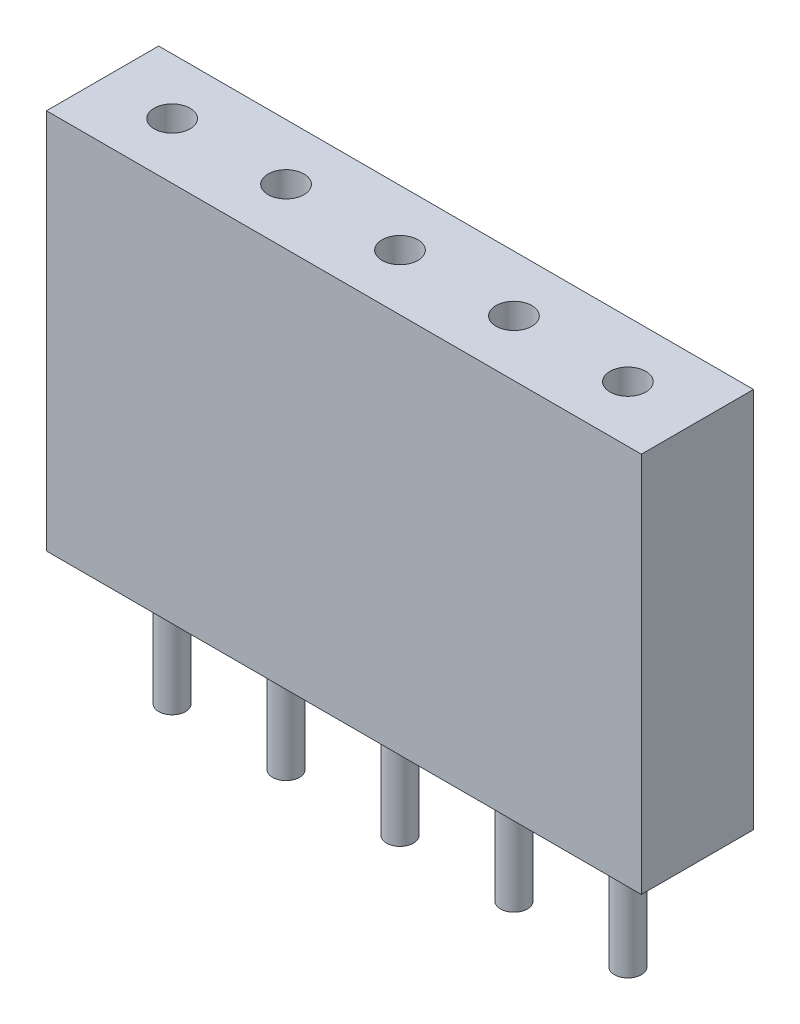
ISO-10303-21;
HEADER;
FILE_DESCRIPTION(('STEP AP214'),'2;1');
FILE_NAME('part.step','',(''),(''),'','','');
FILE_SCHEMA(('AUTOMOTIVE_DESIGN { 1 0 10303 214 1 1 1 1 }'));
ENDSEC;
DATA;
#1=APPLICATION_CONTEXT('core data for automotive mechanical design processes');
#2=APPLICATION_PROTOCOL_DEFINITION('international standard','automotive_design',2000,#1);
#3=PRODUCT_CONTEXT('',#1,'mechanical');
#4=PRODUCT('Part','Part','',(#3));
#5=PRODUCT_RELATED_PRODUCT_CATEGORY('part','',(#4));
#6=PRODUCT_DEFINITION_FORMATION('','',#4);
#7=PRODUCT_DEFINITION_CONTEXT('part definition',#1,'design');
#8=PRODUCT_DEFINITION('design','',#6,#7);
#9=PRODUCT_DEFINITION_SHAPE('','',#8);
#10=(LENGTH_UNIT() NAMED_UNIT(*) SI_UNIT(.MILLI.,.METRE.));
#11=(NAMED_UNIT(*) PLANE_ANGLE_UNIT() SI_UNIT($,.RADIAN.));
#12=(NAMED_UNIT(*) SI_UNIT($,.STERADIAN.) SOLID_ANGLE_UNIT());
#13=UNCERTAINTY_MEASURE_WITH_UNIT(LENGTH_MEASURE(1.E-05),#10,'distance_accuracy_value','');
#14=(GEOMETRIC_REPRESENTATION_CONTEXT(3) GLOBAL_UNCERTAINTY_ASSIGNED_CONTEXT((#13)) GLOBAL_UNIT_ASSIGNED_CONTEXT((#10,
#11,#12)) REPRESENTATION_CONTEXT('',''));
#15=CARTESIAN_POINT('',(0.,0.,0.));
#16=DIRECTION('',(0.,0.,1.));
#17=DIRECTION('',(1.,0.,0.));
#18=AXIS2_PLACEMENT_3D('',#15,#16,#17);
#19=CARTESIAN_POINT('',(0.,0.,2.5));
#20=DIRECTION('',(0.,1.,0.));
#21=DIRECTION('',(0.,0.,1.));
#22=AXIS2_PLACEMENT_3D('',#19,#20,#21);
#23=PLANE('',#22);
#24=CARTESIAN_POINT('',(4.09,0.,1.24999999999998));
#25=DIRECTION('',(0.,1.,0.));
#26=DIRECTION('',(0.,0.,1.));
#27=AXIS2_PLACEMENT_3D('',#24,#25,#26);
#28=CIRCLE('',#27,0.3);
#29=CARTESIAN_POINT('',(4.09,0.,1.54999999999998));
#30=VERTEX_POINT('',#29);
#31=EDGE_CURVE('E45',#30,#30,#28,.F.);
#32=ORIENTED_EDGE('',*,*,#31,.F.);
#33=EDGE_LOOP('',(#32));
#34=FACE_BOUND('',#33,.T.);
#35=CARTESIAN_POINT('',(9.17,0.,1.25));
#36=DIRECTION('',(0.,1.,0.));
#37=DIRECTION('',(0.,0.,1.));
#38=AXIS2_PLACEMENT_3D('',#35,#36,#37);
#39=CIRCLE('',#38,0.3);
#40=CARTESIAN_POINT('',(9.17,0.,1.55));
#41=VERTEX_POINT('',#40);
#42=EDGE_CURVE('E117',#41,#41,#39,.F.);
#43=ORIENTED_EDGE('',*,*,#42,.F.);
#44=EDGE_LOOP('',(#43));
#45=FACE_BOUND('',#44,.T.);
#46=DIRECTION('',(1.,0.,0.));
#47=VECTOR('',#46,1.);
#48=CARTESIAN_POINT('',(0.,0.,0.));
#49=LINE('',#48,#47);
#50=CARTESIAN_POINT('',(0.,0.,0.));
#51=VERTEX_POINT('',#50);
#52=CARTESIAN_POINT('',(13.26,0.,0.));
#53=VERTEX_POINT('',#52);
#54=EDGE_CURVE('E94',#51,#53,#49,.T.);
#55=ORIENTED_EDGE('',*,*,#54,.T.);
#56=DIRECTION('',(0.,0.,-1.));
#57=VECTOR('',#56,1.);
#58=CARTESIAN_POINT('',(13.26,0.,2.5));
#59=LINE('',#58,#57);
#60=CARTESIAN_POINT('',(13.26,0.,2.5));
#61=VERTEX_POINT('',#60);
#62=EDGE_CURVE('E92',#61,#53,#59,.T.);
#63=ORIENTED_EDGE('',*,*,#62,.F.);
#64=DIRECTION('',(1.,0.,0.));
#65=VECTOR('',#64,1.);
#66=CARTESIAN_POINT('',(0.,0.,2.5));
#67=LINE('',#66,#65);
#68=CARTESIAN_POINT('',(0.,0.,2.5));
#69=VERTEX_POINT('',#68);
#70=EDGE_CURVE('E84',#69,#61,#67,.T.);
#71=ORIENTED_EDGE('',*,*,#70,.F.);
#72=DIRECTION('',(0.,0.,-1.));
#73=VECTOR('',#72,1.);
#74=CARTESIAN_POINT('',(0.,0.,2.5));
#75=LINE('',#74,#73);
#76=EDGE_CURVE('E95',#69,#51,#75,.T.);
#77=ORIENTED_EDGE('',*,*,#76,.T.);
#78=EDGE_LOOP('',(#55,#63,#71,#77));
#79=FACE_BOUND('',#78,.T.);
#80=CARTESIAN_POINT('',(6.63,0.,1.25));
#81=DIRECTION('',(0.,1.,0.));
#82=DIRECTION('',(0.,0.,1.));
#83=AXIS2_PLACEMENT_3D('',#80,#81,#82);
#84=CIRCLE('',#83,0.3);
#85=CARTESIAN_POINT('',(6.63,0.,1.55));
#86=VERTEX_POINT('',#85);
#87=EDGE_CURVE('E114',#86,#86,#84,.F.);
#88=ORIENTED_EDGE('',*,*,#87,.F.);
#89=EDGE_LOOP('',(#88));
#90=FACE_BOUND('',#89,.T.);
#91=CARTESIAN_POINT('',(11.71,0.,1.25));
#92=DIRECTION('',(0.,1.,0.));
#93=DIRECTION('',(0.,0.,1.));
#94=AXIS2_PLACEMENT_3D('',#91,#92,#93);
#95=CIRCLE('',#94,0.3);
#96=CARTESIAN_POINT('',(11.71,0.,1.55));
#97=VERTEX_POINT('',#96);
#98=EDGE_CURVE('E120',#97,#97,#95,.F.);
#99=ORIENTED_EDGE('',*,*,#98,.F.);
#100=EDGE_LOOP('',(#99));
#101=FACE_BOUND('',#100,.T.);
#102=CARTESIAN_POINT('',(1.55,0.,1.24999999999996));
#103=DIRECTION('',(0.,1.,0.));
#104=DIRECTION('',(0.,0.,1.));
#105=AXIS2_PLACEMENT_3D('',#102,#103,#104);
#106=CIRCLE('',#105,0.3);
#107=CARTESIAN_POINT('',(1.55,0.,1.54999999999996));
#108=VERTEX_POINT('',#107);
#109=EDGE_CURVE('E11',#108,#108,#106,.F.);
#110=ORIENTED_EDGE('',*,*,#109,.F.);
#111=EDGE_LOOP('',(#110));
#112=FACE_BOUND('',#111,.T.);
#113=ADVANCED_FACE('F36',(#34,#45,#79,#90,#101,#112),#23,.F.);
#114=CARTESIAN_POINT('',(0.,0.,2.5));
#115=DIRECTION('',(1.,0.,0.));
#116=DIRECTION('',(0.,0.,-1.));
#117=AXIS2_PLACEMENT_3D('',#114,#115,#116);
#118=PLANE('',#117);
#119=DIRECTION('',(0.,-1.,0.));
#120=VECTOR('',#119,1.);
#121=CARTESIAN_POINT('',(0.,0.,0.));
#122=LINE('',#121,#120);
#123=CARTESIAN_POINT('',(0.,8.5,0.));
#124=VERTEX_POINT('',#123);
#125=EDGE_CURVE('E104',#124,#51,#122,.T.);
#126=ORIENTED_EDGE('',*,*,#125,.T.);
#127=ORIENTED_EDGE('',*,*,#76,.F.);
#128=DIRECTION('',(0.,-1.,0.));
#129=VECTOR('',#128,1.);
#130=CARTESIAN_POINT('',(0.,0.,2.5));
#131=LINE('',#130,#129);
#132=CARTESIAN_POINT('',(0.,8.5,2.5));
#133=VERTEX_POINT('',#132);
#134=EDGE_CURVE('E89',#133,#69,#131,.T.);
#135=ORIENTED_EDGE('',*,*,#134,.F.);
#136=DIRECTION('',(0.,0.,-1.));
#137=VECTOR('',#136,1.);
#138=CARTESIAN_POINT('',(0.,8.5,2.5));
#139=LINE('',#138,#137);
#140=EDGE_CURVE('E100',#133,#124,#139,.T.);
#141=ORIENTED_EDGE('',*,*,#140,.T.);
#142=EDGE_LOOP('',(#126,#127,#135,#141));
#143=FACE_BOUND('',#142,.T.);
#144=ADVANCED_FACE('F38',(#143),#118,.F.);
#145=CARTESIAN_POINT('',(13.26,0.,2.5));
#146=DIRECTION('',(-1.,0.,0.));
#147=DIRECTION('',(0.,0.,1.));
#148=AXIS2_PLACEMENT_3D('',#145,#146,#147);
#149=PLANE('',#148);
#150=DIRECTION('',(0.,1.,0.));
#151=VECTOR('',#150,1.);
#152=CARTESIAN_POINT('',(13.26,0.,0.));
#153=LINE('',#152,#151);
#154=CARTESIAN_POINT('',(13.26,8.5,0.));
#155=VERTEX_POINT('',#154);
#156=EDGE_CURVE('E70',#53,#155,#153,.T.);
#157=ORIENTED_EDGE('',*,*,#156,.T.);
#158=DIRECTION('',(0.,0.,-1.));
#159=VECTOR('',#158,1.);
#160=CARTESIAN_POINT('',(13.26,8.5,2.5));
#161=LINE('',#160,#159);
#162=CARTESIAN_POINT('',(13.26,8.5,2.5));
#163=VERTEX_POINT('',#162);
#164=EDGE_CURVE('E96',#163,#155,#161,.T.);
#165=ORIENTED_EDGE('',*,*,#164,.F.);
#166=DIRECTION('',(0.,1.,0.));
#167=VECTOR('',#166,1.);
#168=CARTESIAN_POINT('',(13.26,0.,2.5));
#169=LINE('',#168,#167);
#170=EDGE_CURVE('E87',#61,#163,#169,.T.);
#171=ORIENTED_EDGE('',*,*,#170,.F.);
#172=ORIENTED_EDGE('',*,*,#62,.T.);
#173=EDGE_LOOP('',(#157,#165,#171,#172));
#174=FACE_BOUND('',#173,.T.);
#175=ADVANCED_FACE('F98',(#174),#149,.F.);
#176=CARTESIAN_POINT('',(0.,8.5,2.5));
#177=DIRECTION('',(0.,-1.,0.));
#178=DIRECTION('',(0.,0.,-1.));
#179=AXIS2_PLACEMENT_3D('',#176,#177,#178);
#180=PLANE('',#179);
#181=CARTESIAN_POINT('',(1.55,8.5,1.25000000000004));
#182=DIRECTION('',(0.,1.,0.));
#183=DIRECTION('',(0.,0.,1.));
#184=AXIS2_PLACEMENT_3D('',#181,#182,#183);
#185=CIRCLE('',#184,0.4);
#186=CARTESIAN_POINT('',(1.55,8.5,1.65000000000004));
#187=VERTEX_POINT('',#186);
#188=EDGE_CURVE('E211',#187,#187,#185,.T.);
#189=ORIENTED_EDGE('',*,*,#188,.F.);
#190=EDGE_LOOP('',(#189));
#191=FACE_BOUND('',#190,.T.);
#192=CARTESIAN_POINT('',(4.09,8.5,1.25000000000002));
#193=DIRECTION('',(0.,1.,0.));
#194=DIRECTION('',(0.,0.,1.));
#195=AXIS2_PLACEMENT_3D('',#192,#193,#194);
#196=CIRCLE('',#195,0.400000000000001);
#197=CARTESIAN_POINT('',(4.09,8.5,1.65000000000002));
#198=VERTEX_POINT('',#197);
#199=EDGE_CURVE('E205',#198,#198,#196,.T.);
#200=ORIENTED_EDGE('',*,*,#199,.F.);
#201=EDGE_LOOP('',(#200));
#202=FACE_BOUND('',#201,.T.);
#203=CARTESIAN_POINT('',(11.71,8.5,1.25));
#204=DIRECTION('',(0.,1.,0.));
#205=DIRECTION('',(0.,0.,1.));
#206=AXIS2_PLACEMENT_3D('',#203,#204,#205);
#207=CIRCLE('',#206,0.4);
#208=CARTESIAN_POINT('',(11.71,8.5,1.65));
#209=VERTEX_POINT('',#208);
#210=EDGE_CURVE('E199',#209,#209,#207,.T.);
#211=ORIENTED_EDGE('',*,*,#210,.F.);
#212=EDGE_LOOP('',(#211));
#213=FACE_BOUND('',#212,.T.);
#214=CARTESIAN_POINT('',(9.17,8.5,1.25));
#215=DIRECTION('',(0.,1.,0.));
#216=DIRECTION('',(0.,0.,1.));
#217=AXIS2_PLACEMENT_3D('',#214,#215,#216);
#218=CIRCLE('',#217,0.4);
#219=CARTESIAN_POINT('',(9.17,8.5,1.65));
#220=VERTEX_POINT('',#219);
#221=EDGE_CURVE('E193',#220,#220,#218,.T.);
#222=ORIENTED_EDGE('',*,*,#221,.F.);
#223=EDGE_LOOP('',(#222));
#224=FACE_BOUND('',#223,.T.);
#225=CARTESIAN_POINT('',(6.63,8.5,1.25));
#226=DIRECTION('',(0.,1.,0.));
#227=DIRECTION('',(0.,0.,1.));
#228=AXIS2_PLACEMENT_3D('',#225,#226,#227);
#229=CIRCLE('',#228,0.4);
#230=CARTESIAN_POINT('',(6.63,8.5,1.65));
#231=VERTEX_POINT('',#230);
#232=EDGE_CURVE('E187',#231,#231,#229,.T.);
#233=ORIENTED_EDGE('',*,*,#232,.F.);
#234=EDGE_LOOP('',(#233));
#235=FACE_BOUND('',#234,.T.);
#236=DIRECTION('',(-1.,0.,0.));
#237=VECTOR('',#236,1.);
#238=CARTESIAN_POINT('',(0.,8.5,0.));
#239=LINE('',#238,#237);
#240=EDGE_CURVE('E76',#155,#124,#239,.T.);
#241=ORIENTED_EDGE('',*,*,#240,.T.);
#242=ORIENTED_EDGE('',*,*,#140,.F.);
#243=DIRECTION('',(-1.,0.,0.));
#244=VECTOR('',#243,1.);
#245=CARTESIAN_POINT('',(0.,8.5,2.5));
#246=LINE('',#245,#244);
#247=EDGE_CURVE('E53',#163,#133,#246,.T.);
#248=ORIENTED_EDGE('',*,*,#247,.F.);
#249=ORIENTED_EDGE('',*,*,#164,.T.);
#250=EDGE_LOOP('',(#241,#242,#248,#249));
#251=FACE_BOUND('',#250,.T.);
#252=ADVANCED_FACE('F156',(#191,#202,#213,#224,#235,#251),#180,.F.);
#253=CARTESIAN_POINT('',(0.,0.,2.5));
#254=DIRECTION('',(0.,0.,-1.));
#255=DIRECTION('',(-1.,0.,0.));
#256=AXIS2_PLACEMENT_3D('',#253,#254,#255);
#257=PLANE('',#256);
#258=ORIENTED_EDGE('',*,*,#134,.T.);
#259=ORIENTED_EDGE('',*,*,#70,.T.);
#260=ORIENTED_EDGE('',*,*,#170,.T.);
#261=ORIENTED_EDGE('',*,*,#247,.T.);
#262=EDGE_LOOP('',(#258,#259,#260,#261));
#263=FACE_BOUND('',#262,.T.);
#264=ADVANCED_FACE('F85',(#263),#257,.F.);
#265=CARTESIAN_POINT('',(0.,0.,0.));
#266=DIRECTION('',(0.,0.,-1.));
#267=DIRECTION('',(-1.,0.,0.));
#268=AXIS2_PLACEMENT_3D('',#265,#266,#267);
#269=PLANE('',#268);
#270=ORIENTED_EDGE('',*,*,#125,.F.);
#271=ORIENTED_EDGE('',*,*,#240,.F.);
#272=ORIENTED_EDGE('',*,*,#156,.F.);
#273=ORIENTED_EDGE('',*,*,#54,.F.);
#274=EDGE_LOOP('',(#270,#271,#272,#273));
#275=FACE_BOUND('',#274,.T.);
#276=ADVANCED_FACE('F152',(#275),#269,.T.);
#277=CARTESIAN_POINT('',(6.63,-2.8,1.25));
#278=DIRECTION('',(0.,1.,0.));
#279=DIRECTION('',(0.,0.,1.));
#280=AXIS2_PLACEMENT_3D('',#277,#278,#279);
#281=CYLINDRICAL_SURFACE('',#280,0.3);
#282=CARTESIAN_POINT('',(6.63,-2.8,1.25));
#283=DIRECTION('',(0.,-1.,0.));
#284=DIRECTION('',(0.,0.,-1.));
#285=AXIS2_PLACEMENT_3D('',#282,#283,#284);
#286=CIRCLE('',#285,0.3);
#287=CARTESIAN_POINT('',(6.63,-2.8,0.95));
#288=VERTEX_POINT('',#287);
#289=EDGE_CURVE('E107',#288,#288,#286,.T.);
#290=ORIENTED_EDGE('',*,*,#289,.F.);
#291=EDGE_LOOP('',(#290));
#292=FACE_BOUND('',#291,.T.);
#293=ORIENTED_EDGE('',*,*,#87,.T.);
#294=EDGE_LOOP('',(#293));
#295=FACE_BOUND('',#294,.T.);
#296=ADVANCED_FACE('F144',(#292,#295),#281,.T.);
#297=CARTESIAN_POINT('',(6.63,-2.8,1.25));
#298=DIRECTION('',(0.,-1.,0.));
#299=DIRECTION('',(0.,0.,-1.));
#300=AXIS2_PLACEMENT_3D('',#297,#298,#299);
#301=PLANE('',#300);
#302=ORIENTED_EDGE('',*,*,#289,.T.);
#303=EDGE_LOOP('',(#302));
#304=FACE_BOUND('',#303,.T.);
#305=ADVANCED_FACE('F134',(#304),#301,.T.);
#306=CARTESIAN_POINT('',(9.17,-2.8,1.25));
#307=DIRECTION('',(0.,1.,0.));
#308=DIRECTION('',(0.,0.,1.));
#309=AXIS2_PLACEMENT_3D('',#306,#307,#308);
#310=CYLINDRICAL_SURFACE('',#309,0.3);
#311=CARTESIAN_POINT('',(9.17,-2.8,1.25));
#312=DIRECTION('',(0.,-1.,0.));
#313=DIRECTION('',(0.,0.,-1.));
#314=AXIS2_PLACEMENT_3D('',#311,#312,#313);
#315=CIRCLE('',#314,0.3);
#316=CARTESIAN_POINT('',(9.17,-2.8,0.95));
#317=VERTEX_POINT('',#316);
#318=EDGE_CURVE('E174',#317,#317,#315,.T.);
#319=ORIENTED_EDGE('',*,*,#318,.F.);
#320=EDGE_LOOP('',(#319));
#321=FACE_BOUND('',#320,.T.);
#322=ORIENTED_EDGE('',*,*,#42,.T.);
#323=EDGE_LOOP('',(#322));
#324=FACE_BOUND('',#323,.T.);
#325=ADVANCED_FACE('F131',(#321,#324),#310,.T.);
#326=CARTESIAN_POINT('',(9.17,-2.8,1.25));
#327=DIRECTION('',(0.,-1.,0.));
#328=DIRECTION('',(0.,0.,-1.));
#329=AXIS2_PLACEMENT_3D('',#326,#327,#328);
#330=PLANE('',#329);
#331=ORIENTED_EDGE('',*,*,#318,.T.);
#332=EDGE_LOOP('',(#331));
#333=FACE_BOUND('',#332,.T.);
#334=ADVANCED_FACE('F133',(#333),#330,.T.);
#335=CARTESIAN_POINT('',(11.71,-2.8,1.25));
#336=DIRECTION('',(0.,1.,0.));
#337=DIRECTION('',(0.,0.,1.));
#338=AXIS2_PLACEMENT_3D('',#335,#336,#337);
#339=CYLINDRICAL_SURFACE('',#338,0.3);
#340=CARTESIAN_POINT('',(11.71,-2.8,1.25));
#341=DIRECTION('',(0.,-1.,0.));
#342=DIRECTION('',(0.,0.,-1.));
#343=AXIS2_PLACEMENT_3D('',#340,#341,#342);
#344=CIRCLE('',#343,0.3);
#345=CARTESIAN_POINT('',(11.71,-2.8,0.95));
#346=VERTEX_POINT('',#345);
#347=EDGE_CURVE('E177',#346,#346,#344,.T.);
#348=ORIENTED_EDGE('',*,*,#347,.F.);
#349=EDGE_LOOP('',(#348));
#350=FACE_BOUND('',#349,.T.);
#351=ORIENTED_EDGE('',*,*,#98,.T.);
#352=EDGE_LOOP('',(#351));
#353=FACE_BOUND('',#352,.T.);
#354=ADVANCED_FACE('F141',(#350,#353),#339,.T.);
#355=CARTESIAN_POINT('',(11.71,-2.8,1.25));
#356=DIRECTION('',(0.,-1.,0.));
#357=DIRECTION('',(0.,0.,-1.));
#358=AXIS2_PLACEMENT_3D('',#355,#356,#357);
#359=PLANE('',#358);
#360=ORIENTED_EDGE('',*,*,#347,.T.);
#361=EDGE_LOOP('',(#360));
#362=FACE_BOUND('',#361,.T.);
#363=ADVANCED_FACE('F262',(#362),#359,.T.);
#364=CARTESIAN_POINT('',(4.09,-2.8,1.24999999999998));
#365=DIRECTION('',(0.,1.,0.));
#366=DIRECTION('',(0.,0.,1.));
#367=AXIS2_PLACEMENT_3D('',#364,#365,#366);
#368=CYLINDRICAL_SURFACE('',#367,0.3);
#369=CARTESIAN_POINT('',(4.09,-2.8,1.24999999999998));
#370=DIRECTION('',(0.,-1.,0.));
#371=DIRECTION('',(0.,0.,-1.));
#372=AXIS2_PLACEMENT_3D('',#369,#370,#371);
#373=CIRCLE('',#372,0.3);
#374=CARTESIAN_POINT('',(4.09,-2.8,0.949999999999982));
#375=VERTEX_POINT('',#374);
#376=EDGE_CURVE('E180',#375,#375,#373,.T.);
#377=ORIENTED_EDGE('',*,*,#376,.F.);
#378=EDGE_LOOP('',(#377));
#379=FACE_BOUND('',#378,.T.);
#380=ORIENTED_EDGE('',*,*,#31,.T.);
#381=EDGE_LOOP('',(#380));
#382=FACE_BOUND('',#381,.T.);
#383=ADVANCED_FACE('F125',(#379,#382),#368,.T.);
#384=CARTESIAN_POINT('',(4.09,-2.8,1.24999999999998));
#385=DIRECTION('',(0.,-1.,0.));
#386=DIRECTION('',(0.,0.,-1.));
#387=AXIS2_PLACEMENT_3D('',#384,#385,#386);
#388=PLANE('',#387);
#389=ORIENTED_EDGE('',*,*,#376,.T.);
#390=EDGE_LOOP('',(#389));
#391=FACE_BOUND('',#390,.T.);
#392=ADVANCED_FACE('F255',(#391),#388,.T.);
#393=CARTESIAN_POINT('',(1.55,-2.8,1.24999999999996));
#394=DIRECTION('',(0.,1.,0.));
#395=DIRECTION('',(0.,0.,1.));
#396=AXIS2_PLACEMENT_3D('',#393,#394,#395);
#397=CYLINDRICAL_SURFACE('',#396,0.3);
#398=CARTESIAN_POINT('',(1.55,-2.8,1.24999999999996));
#399=DIRECTION('',(0.,-1.,0.));
#400=DIRECTION('',(0.,0.,-1.));
#401=AXIS2_PLACEMENT_3D('',#398,#399,#400);
#402=CIRCLE('',#401,0.3);
#403=CARTESIAN_POINT('',(1.55,-2.8,0.949999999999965));
#404=VERTEX_POINT('',#403);
#405=EDGE_CURVE('E183',#404,#404,#402,.T.);
#406=ORIENTED_EDGE('',*,*,#405,.F.);
#407=EDGE_LOOP('',(#406));
#408=FACE_BOUND('',#407,.T.);
#409=ORIENTED_EDGE('',*,*,#109,.T.);
#410=EDGE_LOOP('',(#409));
#411=FACE_BOUND('',#410,.T.);
#412=ADVANCED_FACE('F247',(#408,#411),#397,.T.);
#413=CARTESIAN_POINT('',(1.55,-2.8,1.24999999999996));
#414=DIRECTION('',(0.,-1.,0.));
#415=DIRECTION('',(0.,0.,-1.));
#416=AXIS2_PLACEMENT_3D('',#413,#414,#415);
#417=PLANE('',#416);
#418=ORIENTED_EDGE('',*,*,#405,.T.);
#419=EDGE_LOOP('',(#418));
#420=FACE_BOUND('',#419,.T.);
#421=ADVANCED_FACE('F237',(#420),#417,.T.);
#422=CARTESIAN_POINT('',(6.63,1.5,1.25));
#423=DIRECTION('',(0.,1.,0.));
#424=DIRECTION('',(0.,0.,1.));
#425=AXIS2_PLACEMENT_3D('',#422,#423,#424);
#426=CYLINDRICAL_SURFACE('',#425,0.4);
#427=CARTESIAN_POINT('',(6.63,1.5,1.25));
#428=DIRECTION('',(0.,1.,0.));
#429=DIRECTION('',(0.,0.,1.));
#430=AXIS2_PLACEMENT_3D('',#427,#428,#429);
#431=CIRCLE('',#430,0.4);
#432=CARTESIAN_POINT('',(6.63,1.5,1.65));
#433=VERTEX_POINT('',#432);
#434=EDGE_CURVE('E186',#433,#433,#431,.T.);
#435=ORIENTED_EDGE('',*,*,#434,.F.);
#436=EDGE_LOOP('',(#435));
#437=FACE_BOUND('',#436,.T.);
#438=ORIENTED_EDGE('',*,*,#232,.T.);
#439=EDGE_LOOP('',(#438));
#440=FACE_BOUND('',#439,.T.);
#441=ADVANCED_FACE('F234',(#437,#440),#426,.F.);
#442=CARTESIAN_POINT('',(6.63,1.5,1.25));
#443=DIRECTION('',(0.,1.,0.));
#444=DIRECTION('',(0.,0.,1.));
#445=AXIS2_PLACEMENT_3D('',#442,#443,#444);
#446=PLANE('',#445);
#447=ORIENTED_EDGE('',*,*,#434,.T.);
#448=EDGE_LOOP('',(#447));
#449=FACE_BOUND('',#448,.T.);
#450=ADVANCED_FACE('F236',(#449),#446,.T.);
#451=CARTESIAN_POINT('',(9.17,1.5,1.25));
#452=DIRECTION('',(0.,1.,0.));
#453=DIRECTION('',(0.,0.,1.));
#454=AXIS2_PLACEMENT_3D('',#451,#452,#453);
#455=CYLINDRICAL_SURFACE('',#454,0.4);
#456=CARTESIAN_POINT('',(9.17,1.5,1.25));
#457=DIRECTION('',(0.,1.,0.));
#458=DIRECTION('',(0.,0.,1.));
#459=AXIS2_PLACEMENT_3D('',#456,#457,#458);
#460=CIRCLE('',#459,0.4);
#461=CARTESIAN_POINT('',(9.17,1.5,1.65));
#462=VERTEX_POINT('',#461);
#463=EDGE_CURVE('E190',#462,#462,#460,.T.);
#464=ORIENTED_EDGE('',*,*,#463,.F.);
#465=EDGE_LOOP('',(#464));
#466=FACE_BOUND('',#465,.T.);
#467=ORIENTED_EDGE('',*,*,#221,.T.);
#468=EDGE_LOOP('',(#467));
#469=FACE_BOUND('',#468,.T.);
#470=ADVANCED_FACE('F244',(#466,#469),#455,.F.);
#471=CARTESIAN_POINT('',(9.17,1.5,1.25));
#472=DIRECTION('',(0.,1.,0.));
#473=DIRECTION('',(0.,0.,1.));
#474=AXIS2_PLACEMENT_3D('',#471,#472,#473);
#475=PLANE('',#474);
#476=ORIENTED_EDGE('',*,*,#463,.T.);
#477=EDGE_LOOP('',(#476));
#478=FACE_BOUND('',#477,.T.);
#479=ADVANCED_FACE('F336',(#478),#475,.T.);
#480=CARTESIAN_POINT('',(11.71,1.5,1.25));
#481=DIRECTION('',(0.,1.,0.));
#482=DIRECTION('',(0.,0.,1.));
#483=AXIS2_PLACEMENT_3D('',#480,#481,#482);
#484=CYLINDRICAL_SURFACE('',#483,0.4);
#485=CARTESIAN_POINT('',(11.71,1.5,1.25));
#486=DIRECTION('',(0.,1.,0.));
#487=DIRECTION('',(0.,0.,1.));
#488=AXIS2_PLACEMENT_3D('',#485,#486,#487);
#489=CIRCLE('',#488,0.4);
#490=CARTESIAN_POINT('',(11.71,1.5,1.65));
#491=VERTEX_POINT('',#490);
#492=EDGE_CURVE('E196',#491,#491,#489,.T.);
#493=ORIENTED_EDGE('',*,*,#492,.F.);
#494=EDGE_LOOP('',(#493));
#495=FACE_BOUND('',#494,.T.);
#496=ORIENTED_EDGE('',*,*,#210,.T.);
#497=EDGE_LOOP('',(#496));
#498=FACE_BOUND('',#497,.T.);
#499=ADVANCED_FACE('F345',(#495,#498),#484,.F.);
#500=CARTESIAN_POINT('',(11.71,1.5,1.25));
#501=DIRECTION('',(0.,1.,0.));
#502=DIRECTION('',(0.,0.,1.));
#503=AXIS2_PLACEMENT_3D('',#500,#501,#502);
#504=PLANE('',#503);
#505=ORIENTED_EDGE('',*,*,#492,.T.);
#506=EDGE_LOOP('',(#505));
#507=FACE_BOUND('',#506,.T.);
#508=ADVANCED_FACE('F355',(#507),#504,.T.);
#509=CARTESIAN_POINT('',(4.09,1.5,1.25000000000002));
#510=DIRECTION('',(0.,1.,0.));
#511=DIRECTION('',(0.,0.,1.));
#512=AXIS2_PLACEMENT_3D('',#509,#510,#511);
#513=CYLINDRICAL_SURFACE('',#512,0.400000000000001);
#514=CARTESIAN_POINT('',(4.09,1.5,1.25000000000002));
#515=DIRECTION('',(0.,1.,0.));
#516=DIRECTION('',(0.,0.,1.));
#517=AXIS2_PLACEMENT_3D('',#514,#515,#516);
#518=CIRCLE('',#517,0.400000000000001);
#519=CARTESIAN_POINT('',(4.09,1.5,1.65000000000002));
#520=VERTEX_POINT('',#519);
#521=EDGE_CURVE('E202',#520,#520,#518,.T.);
#522=ORIENTED_EDGE('',*,*,#521,.F.);
#523=EDGE_LOOP('',(#522));
#524=FACE_BOUND('',#523,.T.);
#525=ORIENTED_EDGE('',*,*,#199,.T.);
#526=EDGE_LOOP('',(#525));
#527=FACE_BOUND('',#526,.T.);
#528=ADVANCED_FACE('F365',(#524,#527),#513,.F.);
#529=CARTESIAN_POINT('',(4.09,1.5,1.25000000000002));
#530=DIRECTION('',(0.,1.,0.));
#531=DIRECTION('',(0.,0.,1.));
#532=AXIS2_PLACEMENT_3D('',#529,#530,#531);
#533=PLANE('',#532);
#534=ORIENTED_EDGE('',*,*,#521,.T.);
#535=EDGE_LOOP('',(#534));
#536=FACE_BOUND('',#535,.T.);
#537=ADVANCED_FACE('F222',(#536),#533,.T.);
#538=CARTESIAN_POINT('',(1.55,1.5,1.25000000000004));
#539=DIRECTION('',(0.,1.,0.));
#540=DIRECTION('',(0.,0.,1.));
#541=AXIS2_PLACEMENT_3D('',#538,#539,#540);
#542=CYLINDRICAL_SURFACE('',#541,0.4);
#543=CARTESIAN_POINT('',(1.55,1.5,1.25000000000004));
#544=DIRECTION('',(0.,1.,0.));
#545=DIRECTION('',(0.,0.,1.));
#546=AXIS2_PLACEMENT_3D('',#543,#544,#545);
#547=CIRCLE('',#546,0.4);
#548=CARTESIAN_POINT('',(1.55,1.5,1.65000000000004));
#549=VERTEX_POINT('',#548);
#550=EDGE_CURVE('E208',#549,#549,#547,.T.);
#551=ORIENTED_EDGE('',*,*,#550,.F.);
#552=EDGE_LOOP('',(#551));
#553=FACE_BOUND('',#552,.T.);
#554=ORIENTED_EDGE('',*,*,#188,.T.);
#555=EDGE_LOOP('',(#554));
#556=FACE_BOUND('',#555,.T.);
#557=ADVANCED_FACE('F219',(#553,#556),#542,.F.);
#558=CARTESIAN_POINT('',(1.55,1.5,1.25000000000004));
#559=DIRECTION('',(0.,1.,0.));
#560=DIRECTION('',(0.,0.,1.));
#561=AXIS2_PLACEMENT_3D('',#558,#559,#560);
#562=PLANE('',#561);
#563=ORIENTED_EDGE('',*,*,#550,.T.);
#564=EDGE_LOOP('',(#563));
#565=FACE_BOUND('',#564,.T.);
#566=ADVANCED_FACE('F217',(#565),#562,.T.);
#567=CLOSED_SHELL('',(#113,#144,#175,#252,#264,#276,#296,#305,#325,#334,#354,#363,#383,#392,
#412,#421,#441,#450,#470,#479,#499,#508,#528,#537,#557,#566));
#568=MANIFOLD_SOLID_BREP('B2',#567);
#569=ADVANCED_BREP_SHAPE_REPRESENTATION('',(#18,#568),#14);
#570=SHAPE_DEFINITION_REPRESENTATION(#9,#569);
ENDSEC;
END-ISO-10303-21;
